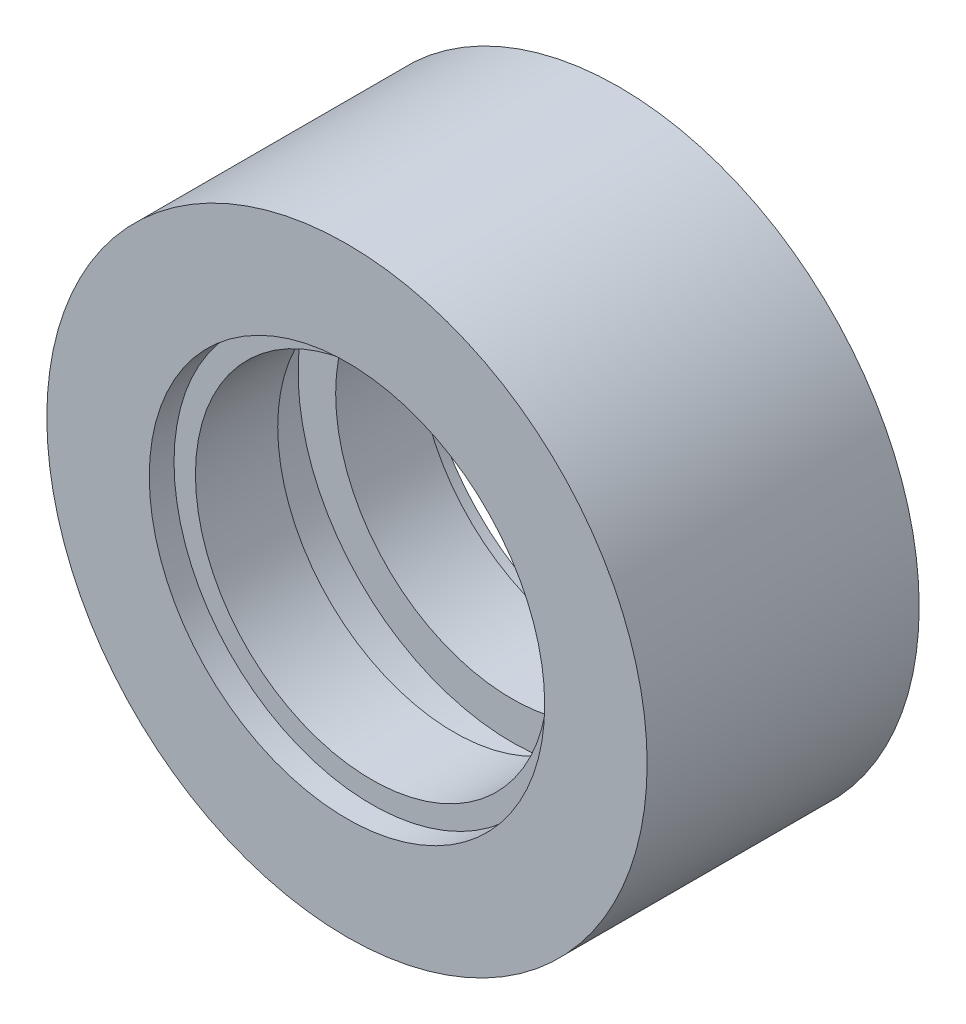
from build123d import *

# Parameters (mm, degrees)
SZKIC1_R                    = 14.3
DODANIE_WYCI_GNI_CIE1_DEPTH = 12.96
WYTNIJ_WYCI_GNI_CIE1_REACH  = 26.02
SZKIC2_R                    = 8.4
SZKIC3_R                    = 9.42
WYTNIJ_WYCI_GNI_CIE2_DEPTH  = 1.18
SZKIC5_R                    = 10.19
WYTNIJ_WYCI_GNI_CIE3_DEPTH  = 1.38


with BuildPart() as part:
    # Szkic1 → Dodanie-wyci_gni_cie1 (new body)
    with BuildSketch(Plane.XY):
        Circle(SZKIC1_R)
    extrude(amount=DODANIE_WYCI_GNI_CIE1_DEPTH)

    # Szkic2 → Wytnij-wyci_gni_cie1 (cut, up to next)
    with BuildSketch(Plane.XY.offset(12.96), mode=Mode.PRIVATE) as wytnij_wyci_gni_cie1_sk1:
        Circle(SZKIC2_R)
    wytnij_wyci_gni_cie1_tool1 = extrude(wytnij_wyci_gni_cie1_sk1.sketch, amount=-WYTNIJ_WYCI_GNI_CIE1_REACH, mode=Mode.PRIVATE) & part.part
    add(wytnij_wyci_gni_cie1_tool1.solids().sort_by_distance((0, 0, 12.96))[0], mode=Mode.SUBTRACT)

    # Szkic3 → Wytnij-wyci_gni_cie2 (cut)
    with BuildSketch(Plane.XY.offset(12.96)):
        Circle(SZKIC3_R)
    wytnij_wyci_gni_cie2 = extrude(amount=-WYTNIJ_WYCI_GNI_CIE2_DEPTH, mode=Mode.SUBTRACT)

    # Lustro1: Wytnij-wyci_gni_cie2 across plane
    add(wytnij_wyci_gni_cie2.mirror(Plane.XY.offset(6.48)), mode=Mode.SUBTRACT)

    # Szkic5 → Wytnij-wyci_gni_cie3 (cut, symmetric)
    with BuildSketch(Plane.XY.offset(6.48)):
        Circle(SZKIC5_R)
    extrude(amount=WYTNIJ_WYCI_GNI_CIE3_DEPTH, both=True, mode=Mode.SUBTRACT)


solid = part.part
